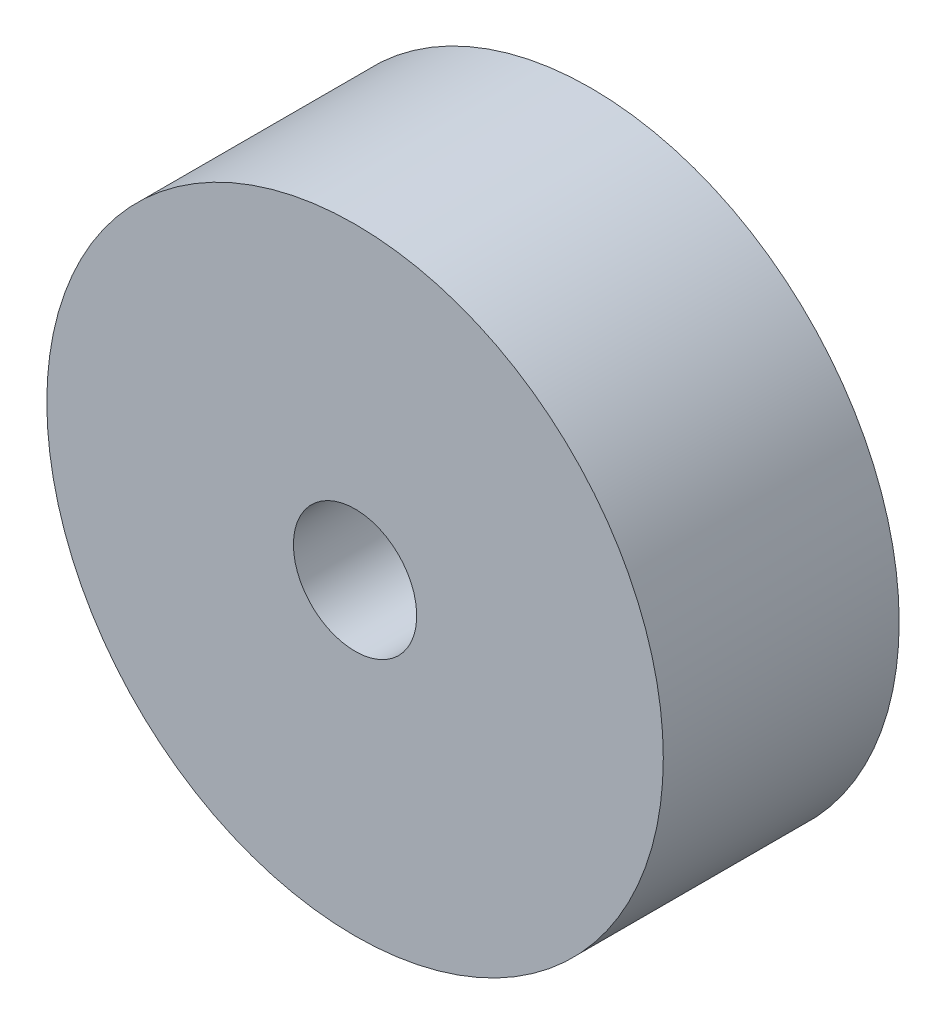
from build123d import *

# Parameters (mm, degrees)
SKETCH3_W   = 24.869565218
SKETCH3_H   = 26
SKETCH3_W_2 = 22
SKETCH3_H_2 = 23


with BuildPart() as part:
    # Sketch3 → Revolve1 (revolve)
    with BuildSketch(Plane(origin=(0, 0, 0), x_dir=(0, 0, -1), z_dir=(1, 0, 0)), mode=Mode.PRIVATE) as revolve1_sk:
        with Locations((0, 19.5)):
            Rectangle(SKETCH3_W, SKETCH3_H)
        with Locations((0, 19.5)):
            Rectangle(SKETCH3_W_2, SKETCH3_H_2, mode=Mode.SUBTRACT)
    revolve(revolve1_sk.sketch.rotate(Axis((0, 0, -88.99), (0, 0, 1)), 90), axis=Axis((0, 0, -88.99), (0, 0, 1)))


solid = part.part
